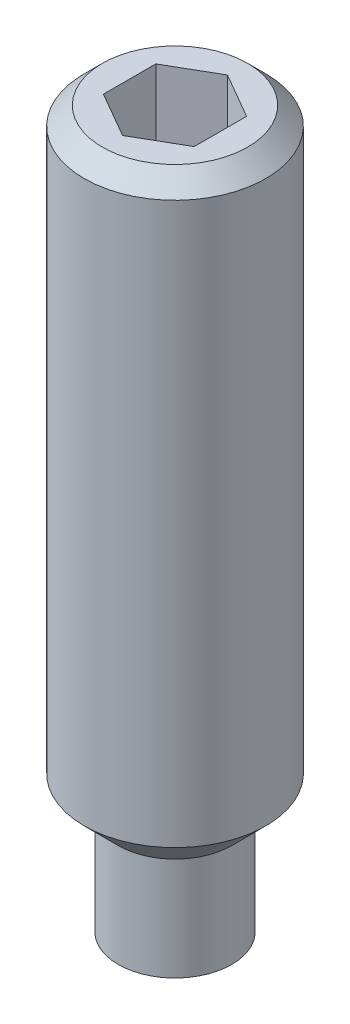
ISO-10303-21;
HEADER;
FILE_DESCRIPTION(('STEP AP214'),'2;1');
FILE_NAME('part.step','',(''),(''),'','','');
FILE_SCHEMA(('AUTOMOTIVE_DESIGN { 1 0 10303 214 1 1 1 1 }'));
ENDSEC;
DATA;
#1=APPLICATION_CONTEXT('core data for automotive mechanical design processes');
#2=APPLICATION_PROTOCOL_DEFINITION('international standard','automotive_design',2000,#1);
#3=PRODUCT_CONTEXT('',#1,'mechanical');
#4=PRODUCT('Part','Part','',(#3));
#5=PRODUCT_RELATED_PRODUCT_CATEGORY('part','',(#4));
#6=PRODUCT_DEFINITION_FORMATION('','',#4);
#7=PRODUCT_DEFINITION_CONTEXT('part definition',#1,'design');
#8=PRODUCT_DEFINITION('design','',#6,#7);
#9=PRODUCT_DEFINITION_SHAPE('','',#8);
#10=(LENGTH_UNIT() NAMED_UNIT(*) SI_UNIT(.MILLI.,.METRE.));
#11=(NAMED_UNIT(*) PLANE_ANGLE_UNIT() SI_UNIT($,.RADIAN.));
#12=(NAMED_UNIT(*) SI_UNIT($,.STERADIAN.) SOLID_ANGLE_UNIT());
#13=UNCERTAINTY_MEASURE_WITH_UNIT(LENGTH_MEASURE(1.E-05),#10,'distance_accuracy_value','');
#14=(GEOMETRIC_REPRESENTATION_CONTEXT(3) GLOBAL_UNCERTAINTY_ASSIGNED_CONTEXT((#13)) GLOBAL_UNIT_ASSIGNED_CONTEXT((#10,
#11,#12)) REPRESENTATION_CONTEXT('',''));
#15=CARTESIAN_POINT('',(0.,0.,0.));
#16=DIRECTION('',(0.,0.,1.));
#17=DIRECTION('',(1.,0.,0.));
#18=AXIS2_PLACEMENT_3D('',#15,#16,#17);
#19=CARTESIAN_POINT('',(0.,0.,0.));
#20=DIRECTION('',(0.,1.,0.));
#21=DIRECTION('',(0.,0.,1.));
#22=AXIS2_PLACEMENT_3D('',#19,#20,#21);
#23=CYLINDRICAL_SURFACE('',#22,2.);
#24=CARTESIAN_POINT('',(0.,-12.75,0.));
#25=DIRECTION('',(0.,1.,0.));
#26=DIRECTION('',(0.,0.,1.));
#27=AXIS2_PLACEMENT_3D('',#24,#25,#26);
#28=CIRCLE('',#27,2.);
#29=CARTESIAN_POINT('',(0.,-12.75,2.));
#30=VERTEX_POINT('',#29);
#31=EDGE_CURVE('E11',#30,#30,#28,.T.);
#32=ORIENTED_EDGE('',*,*,#31,.T.);
#33=EDGE_LOOP('',(#32));
#34=FACE_BOUND('',#33,.T.);
#35=CARTESIAN_POINT('',(0.,-0.400000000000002,0.));
#36=DIRECTION('',(0.,-1.,0.));
#37=DIRECTION('',(0.,0.,-1.));
#38=AXIS2_PLACEMENT_3D('',#35,#36,#37);
#39=CIRCLE('',#38,2.);
#40=CARTESIAN_POINT('',(0.,-0.400000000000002,-2.));
#41=VERTEX_POINT('',#40);
#42=EDGE_CURVE('E144',#41,#41,#39,.T.);
#43=ORIENTED_EDGE('',*,*,#42,.T.);
#44=EDGE_LOOP('',(#43));
#45=FACE_BOUND('',#44,.T.);
#46=ADVANCED_FACE('F29',(#34,#45),#23,.T.);
#47=CARTESIAN_POINT('',(0.,0.,0.));
#48=DIRECTION('',(0.,-1.,0.));
#49=DIRECTION('',(0.,0.,-1.));
#50=AXIS2_PLACEMENT_3D('',#47,#48,#49);
#51=PLANE('',#50);
#52=DIRECTION('',(0.866025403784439,0.,-0.5));
#53=VECTOR('',#52,1.);
#54=CARTESIAN_POINT('',(0.,0.,1.15470053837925));
#55=LINE('',#54,#53);
#56=CARTESIAN_POINT('',(0.,0.,1.15470053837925));
#57=VERTEX_POINT('',#56);
#58=CARTESIAN_POINT('',(0.999999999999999,0.,0.577350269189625));
#59=VERTEX_POINT('',#58);
#60=EDGE_CURVE('E98',#57,#59,#55,.T.);
#61=ORIENTED_EDGE('',*,*,#60,.F.);
#62=DIRECTION('',(0.866025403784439,0.,0.5));
#63=VECTOR('',#62,1.);
#64=CARTESIAN_POINT('',(-0.999999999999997,0.,0.577350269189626));
#65=LINE('',#64,#63);
#66=CARTESIAN_POINT('',(-0.999999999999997,0.,0.577350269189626));
#67=VERTEX_POINT('',#66);
#68=EDGE_CURVE('E44',#67,#57,#65,.T.);
#69=ORIENTED_EDGE('',*,*,#68,.F.);
#70=DIRECTION('',(0.,0.,1.));
#71=VECTOR('',#70,1.);
#72=CARTESIAN_POINT('',(-0.999999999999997,0.,-0.577350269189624));
#73=LINE('',#72,#71);
#74=CARTESIAN_POINT('',(-0.999999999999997,0.,-0.577350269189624));
#75=VERTEX_POINT('',#74);
#76=EDGE_CURVE('E114',#75,#67,#73,.T.);
#77=ORIENTED_EDGE('',*,*,#76,.F.);
#78=DIRECTION('',(-0.866025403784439,0.,0.5));
#79=VECTOR('',#78,1.);
#80=CARTESIAN_POINT('',(0.,0.,-1.15470053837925));
#81=LINE('',#80,#79);
#82=CARTESIAN_POINT('',(0.,0.,-1.15470053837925));
#83=VERTEX_POINT('',#82);
#84=EDGE_CURVE('E108',#83,#75,#81,.T.);
#85=ORIENTED_EDGE('',*,*,#84,.F.);
#86=DIRECTION('',(-0.866025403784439,0.,-0.5));
#87=VECTOR('',#86,1.);
#88=CARTESIAN_POINT('',(0.999999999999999,0.,-0.577350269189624));
#89=LINE('',#88,#87);
#90=CARTESIAN_POINT('',(0.999999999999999,0.,-0.577350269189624));
#91=VERTEX_POINT('',#90);
#92=EDGE_CURVE('E106',#91,#83,#89,.T.);
#93=ORIENTED_EDGE('',*,*,#92,.F.);
#94=DIRECTION('',(0.,0.,-1.));
#95=VECTOR('',#94,1.);
#96=CARTESIAN_POINT('',(0.999999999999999,0.,0.577350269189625));
#97=LINE('',#96,#95);
#98=EDGE_CURVE('E87',#59,#91,#97,.T.);
#99=ORIENTED_EDGE('',*,*,#98,.F.);
#100=EDGE_LOOP('',(#61,#69,#77,#85,#93,#99));
#101=FACE_BOUND('',#100,.T.);
#102=CARTESIAN_POINT('',(0.,0.,0.));
#103=DIRECTION('',(0.,-1.,0.));
#104=DIRECTION('',(0.,0.,-1.));
#105=AXIS2_PLACEMENT_3D('',#102,#103,#104);
#106=CIRCLE('',#105,1.6);
#107=CARTESIAN_POINT('',(0.,0.,-1.6));
#108=VERTEX_POINT('',#107);
#109=EDGE_CURVE('E141',#108,#108,#106,.F.);
#110=ORIENTED_EDGE('',*,*,#109,.T.);
#111=EDGE_LOOP('',(#110));
#112=FACE_BOUND('',#111,.T.);
#113=ADVANCED_FACE('F102',(#101,#112),#51,.F.);
#114=CARTESIAN_POINT('',(0.,0.,0.));
#115=DIRECTION('',(0.,-1.,0.));
#116=DIRECTION('',(0.,0.,-1.));
#117=AXIS2_PLACEMENT_3D('',#114,#115,#116);
#118=CONICAL_SURFACE('',#117,1.6,0.785398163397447);
#119=CARTESIAN_POINT('',(0.,-0.400000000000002,-2.));
#120=CARTESIAN_POINT('',(0.,-0.395833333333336,-1.99583333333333));
#121=CARTESIAN_POINT('',(0.,-0.391666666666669,-1.99166666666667));
#122=CARTESIAN_POINT('',(0.,-0.383333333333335,-1.98333333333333));
#123=CARTESIAN_POINT('',(0.,-0.379166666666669,-1.97916666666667));
#124=CARTESIAN_POINT('',(0.,-0.370833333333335,-1.97083333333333));
#125=CARTESIAN_POINT('',(0.,-0.366666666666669,-1.96666666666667));
#126=CARTESIAN_POINT('',(0.,-0.358333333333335,-1.95833333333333));
#127=CARTESIAN_POINT('',(0.,-0.354166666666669,-1.95416666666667));
#128=CARTESIAN_POINT('',(0.,-0.345833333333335,-1.94583333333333));
#129=CARTESIAN_POINT('',(0.,-0.341666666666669,-1.94166666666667));
#130=CARTESIAN_POINT('',(0.,-0.333333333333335,-1.93333333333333));
#131=CARTESIAN_POINT('',(0.,-0.329166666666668,-1.92916666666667));
#132=CARTESIAN_POINT('',(0.,-0.320833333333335,-1.92083333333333));
#133=CARTESIAN_POINT('',(0.,-0.316666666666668,-1.91666666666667));
#134=CARTESIAN_POINT('',(0.,-0.308333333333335,-1.90833333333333));
#135=CARTESIAN_POINT('',(0.,-0.304166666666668,-1.90416666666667));
#136=CARTESIAN_POINT('',(0.,-0.295833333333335,-1.89583333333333));
#137=CARTESIAN_POINT('',(0.,-0.291666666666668,-1.89166666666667));
#138=CARTESIAN_POINT('',(0.,-0.283333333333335,-1.88333333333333));
#139=CARTESIAN_POINT('',(0.,-0.279166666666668,-1.87916666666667));
#140=CARTESIAN_POINT('',(0.,-0.270833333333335,-1.87083333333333));
#141=CARTESIAN_POINT('',(0.,-0.266666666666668,-1.86666666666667));
#142=CARTESIAN_POINT('',(0.,-0.258333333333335,-1.85833333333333));
#143=CARTESIAN_POINT('',(0.,-0.254166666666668,-1.85416666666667));
#144=CARTESIAN_POINT('',(0.,-0.245833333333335,-1.84583333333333));
#145=CARTESIAN_POINT('',(0.,-0.241666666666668,-1.84166666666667));
#146=CARTESIAN_POINT('',(0.,-0.233333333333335,-1.83333333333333));
#147=CARTESIAN_POINT('',(0.,-0.229166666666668,-1.82916666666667));
#148=CARTESIAN_POINT('',(0.,-0.220833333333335,-1.82083333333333));
#149=CARTESIAN_POINT('',(0.,-0.216666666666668,-1.81666666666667));
#150=CARTESIAN_POINT('',(0.,-0.208333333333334,-1.80833333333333));
#151=CARTESIAN_POINT('',(0.,-0.204166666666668,-1.80416666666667));
#152=CARTESIAN_POINT('',(0.,-0.195833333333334,-1.79583333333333));
#153=CARTESIAN_POINT('',(0.,-0.191666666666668,-1.79166666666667));
#154=CARTESIAN_POINT('',(0.,-0.183333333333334,-1.78333333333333));
#155=CARTESIAN_POINT('',(0.,-0.179166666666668,-1.77916666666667));
#156=CARTESIAN_POINT('',(0.,-0.170833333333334,-1.77083333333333));
#157=CARTESIAN_POINT('',(0.,-0.166666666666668,-1.76666666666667));
#158=CARTESIAN_POINT('',(0.,-0.158333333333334,-1.75833333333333));
#159=CARTESIAN_POINT('',(0.,-0.154166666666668,-1.75416666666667));
#160=CARTESIAN_POINT('',(0.,-0.145833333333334,-1.74583333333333));
#161=CARTESIAN_POINT('',(0.,-0.141666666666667,-1.74166666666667));
#162=CARTESIAN_POINT('',(0.,-0.133333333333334,-1.73333333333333));
#163=CARTESIAN_POINT('',(0.,-0.129166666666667,-1.72916666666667));
#164=CARTESIAN_POINT('',(0.,-0.120833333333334,-1.72083333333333));
#165=CARTESIAN_POINT('',(0.,-0.116666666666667,-1.71666666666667));
#166=CARTESIAN_POINT('',(0.,-0.108333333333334,-1.70833333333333));
#167=CARTESIAN_POINT('',(0.,-0.104166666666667,-1.70416666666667));
#168=CARTESIAN_POINT('',(0.,-0.0958333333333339,-1.69583333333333));
#169=CARTESIAN_POINT('',(0.,-0.0916666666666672,-1.69166666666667));
#170=CARTESIAN_POINT('',(0.,-0.0833333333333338,-1.68333333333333));
#171=CARTESIAN_POINT('',(0.,-0.0791666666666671,-1.67916666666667));
#172=CARTESIAN_POINT('',(0.,-0.0708333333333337,-1.67083333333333));
#173=CARTESIAN_POINT('',(0.,-0.066666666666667,-1.66666666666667));
#174=CARTESIAN_POINT('',(0.,-0.0583333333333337,-1.65833333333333));
#175=CARTESIAN_POINT('',(0.,-0.054166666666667,-1.65416666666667));
#176=CARTESIAN_POINT('',(0.,-0.0458333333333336,-1.64583333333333));
#177=CARTESIAN_POINT('',(0.,-0.0416666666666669,-1.64166666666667));
#178=CARTESIAN_POINT('',(0.,-0.0333333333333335,-1.63333333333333));
#179=CARTESIAN_POINT('',(0.,-0.0291666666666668,-1.62916666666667));
#180=CARTESIAN_POINT('',(0.,-0.0208333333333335,-1.62083333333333));
#181=CARTESIAN_POINT('',(0.,-0.0166666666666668,-1.61666666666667));
#182=CARTESIAN_POINT('',(0.,-0.00833333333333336,-1.60833333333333));
#183=CARTESIAN_POINT('',(0.,-0.00416666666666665,-1.60416666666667));
#184=CARTESIAN_POINT('',(0.,0.,-1.6));
#185=B_SPLINE_CURVE_WITH_KNOTS('',3,(#119,#120,#121,#122,#123,#124,#125,#126,#127,#128,#129,
#130,#131,#132,#133,#134,#135,#136,#137,#138,#139,#140,#141,#142,#143,#144,#145,#146,#147,#148,
#149,#150,#151,#152,#153,#154,#155,#156,#157,#158,#159,#160,#161,#162,#163,#164,#165,#166,#167,
#168,#169,#170,#171,#172,#173,#174,#175,#176,#177,#178,#179,#180,#181,#182,#183,#184),
.UNSPECIFIED.,.F.,.F.,(4,2,2,2,2,2,2,2,2,2,2,2,2,2,2,2,2,2,2,2,2,2,2,2,2,2,2,2,2,2,2,2,4),(0.,
0.0176776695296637,0.0353553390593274,0.0530330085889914,0.0707106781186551,0.0883883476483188,
0.106066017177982,0.123743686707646,0.14142135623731,0.159099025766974,0.176776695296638,
0.194454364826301,0.212132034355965,0.229809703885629,0.247487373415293,0.265165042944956,
0.28284271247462,0.300520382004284,0.318198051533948,0.335875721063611,0.353553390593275,
0.371231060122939,0.388908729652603,0.406586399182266,0.42426406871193,0.441941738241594,
0.459619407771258,0.477297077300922,0.494974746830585,0.512652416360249,0.530330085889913,
0.548007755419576,0.56568542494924),.UNSPECIFIED.);
#186=EDGE_CURVE('BSEAM166',#41,#108,#185,.T.);
#187=ORIENTED_EDGE('',*,*,#42,.F.);
#188=ORIENTED_EDGE('',*,*,#109,.F.);
#189=ORIENTED_EDGE('',*,*,#186,.T.);
#190=ORIENTED_EDGE('',*,*,#186,.F.);
#191=EDGE_LOOP('',(#187,#189,#188,#190));
#192=FACE_BOUND('',#191,.T.);
#193=ADVANCED_FACE('F166',(#192),#118,.T.);
#194=CARTESIAN_POINT('',(0.,-20.7033639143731,0.));
#195=DIRECTION('',(0.,-1.,0.));
#196=DIRECTION('',(0.,0.,-1.));
#197=AXIS2_PLACEMENT_3D('',#194,#195,#196);
#198=CYLINDRICAL_SURFACE('',#197,1.25);
#199=CARTESIAN_POINT('',(0.,-15.7690598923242,0.));
#200=DIRECTION('',(0.,1.,0.));
#201=DIRECTION('',(0.,0.,1.));
#202=AXIS2_PLACEMENT_3D('',#199,#200,#201);
#203=CIRCLE('',#202,1.25);
#204=CARTESIAN_POINT('',(0.,-15.7690598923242,1.25));
#205=VERTEX_POINT('',#204);
#206=EDGE_CURVE('E37',#205,#205,#203,.T.);
#207=ORIENTED_EDGE('',*,*,#206,.T.);
#208=EDGE_LOOP('',(#207));
#209=FACE_BOUND('',#208,.T.);
#210=CARTESIAN_POINT('',(0.,-13.5,0.));
#211=DIRECTION('',(0.,-1.,0.));
#212=DIRECTION('',(0.,0.,-1.));
#213=AXIS2_PLACEMENT_3D('',#210,#211,#212);
#214=CIRCLE('',#213,1.25);
#215=CARTESIAN_POINT('',(0.,-13.5,-1.25));
#216=VERTEX_POINT('',#215);
#217=EDGE_CURVE('E132',#216,#216,#214,.T.);
#218=ORIENTED_EDGE('',*,*,#217,.T.);
#219=EDGE_LOOP('',(#218));
#220=FACE_BOUND('',#219,.T.);
#221=ADVANCED_FACE('F152',(#209,#220),#198,.T.);
#222=CARTESIAN_POINT('',(0.,-16.,0.));
#223=DIRECTION('',(0.,1.,0.));
#224=DIRECTION('',(0.,0.,1.));
#225=AXIS2_PLACEMENT_3D('',#222,#223,#224);
#226=PLANE('',#225);
#227=CARTESIAN_POINT('',(0.,-16.,0.));
#228=DIRECTION('',(0.,1.,0.));
#229=DIRECTION('',(0.,0.,1.));
#230=AXIS2_PLACEMENT_3D('',#227,#228,#229);
#231=CIRCLE('',#230,0.850000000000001);
#232=CARTESIAN_POINT('',(0.,-16.,0.849999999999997));
#233=VERTEX_POINT('',#232);
#234=EDGE_CURVE('E147',#233,#233,#231,.F.);
#235=ORIENTED_EDGE('',*,*,#234,.T.);
#236=EDGE_LOOP('',(#235));
#237=FACE_BOUND('',#236,.T.);
#238=ADVANCED_FACE('F31',(#237),#226,.F.);
#239=CARTESIAN_POINT('',(0.,-16.,0.));
#240=DIRECTION('',(0.,1.,0.));
#241=DIRECTION('',(0.,0.,1.));
#242=AXIS2_PLACEMENT_3D('',#239,#240,#241);
#243=CONICAL_SURFACE('',#242,0.850000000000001,1.0471975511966);
#244=CARTESIAN_POINT('',(0.,-15.7690598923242,1.25));
#245=CARTESIAN_POINT('',(0.,-15.7714655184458,1.24583333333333));
#246=CARTESIAN_POINT('',(0.,-15.7738711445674,1.24166666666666));
#247=CARTESIAN_POINT('',(0.,-15.7786823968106,1.23333333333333));
#248=CARTESIAN_POINT('',(0.,-15.7810880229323,1.22916666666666));
#249=CARTESIAN_POINT('',(0.,-15.7858992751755,1.22083333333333));
#250=CARTESIAN_POINT('',(0.,-15.7883049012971,1.21666666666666));
#251=CARTESIAN_POINT('',(0.,-15.7931161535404,1.20833333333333));
#252=CARTESIAN_POINT('',(0.,-15.795521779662,1.20416666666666));
#253=CARTESIAN_POINT('',(0.,-15.8003330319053,1.19583333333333));
#254=CARTESIAN_POINT('',(0.,-15.8027386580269,1.19166666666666));
#255=CARTESIAN_POINT('',(0.,-15.8075499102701,1.18333333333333));
#256=CARTESIAN_POINT('',(0.,-15.8099555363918,1.17916666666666));
#257=CARTESIAN_POINT('',(0.,-15.814766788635,1.17083333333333));
#258=CARTESIAN_POINT('',(0.,-15.8171724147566,1.16666666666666));
#259=CARTESIAN_POINT('',(0.,-15.8219836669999,1.15833333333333));
#260=CARTESIAN_POINT('',(0.,-15.8243892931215,1.15416666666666));
#261=CARTESIAN_POINT('',(0.,-15.8292005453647,1.14583333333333));
#262=CARTESIAN_POINT('',(0.,-15.8316061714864,1.14166666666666));
#263=CARTESIAN_POINT('',(0.,-15.8364174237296,1.13333333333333));
#264=CARTESIAN_POINT('',(0.,-15.8388230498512,1.12916666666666));
#265=CARTESIAN_POINT('',(0.,-15.8436343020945,1.12083333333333));
#266=CARTESIAN_POINT('',(0.,-15.8460399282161,1.11666666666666));
#267=CARTESIAN_POINT('',(0.,-15.8508511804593,1.10833333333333));
#268=CARTESIAN_POINT('',(0.,-15.853256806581,1.10416666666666));
#269=CARTESIAN_POINT('',(0.,-15.8580680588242,1.09583333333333));
#270=CARTESIAN_POINT('',(0.,-15.8604736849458,1.09166666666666));
#271=CARTESIAN_POINT('',(0.,-15.8652849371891,1.08333333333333));
#272=CARTESIAN_POINT('',(0.,-15.8676905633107,1.07916666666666));
#273=CARTESIAN_POINT('',(0.,-15.872501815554,1.07083333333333));
#274=CARTESIAN_POINT('',(0.,-15.8749074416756,1.06666666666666));
#275=CARTESIAN_POINT('',(0.,-15.8797186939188,1.05833333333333));
#276=CARTESIAN_POINT('',(0.,-15.8821243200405,1.05416666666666));
#277=CARTESIAN_POINT('',(0.,-15.8869355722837,1.04583333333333));
#278=CARTESIAN_POINT('',(0.,-15.8893411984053,1.04166666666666));
#279=CARTESIAN_POINT('',(0.,-15.8941524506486,1.03333333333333));
#280=CARTESIAN_POINT('',(0.,-15.8965580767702,1.02916666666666));
#281=CARTESIAN_POINT('',(0.,-15.9013693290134,1.02083333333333));
#282=CARTESIAN_POINT('',(0.,-15.9037749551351,1.01666666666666));
#283=CARTESIAN_POINT('',(0.,-15.9085862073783,1.00833333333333));
#284=CARTESIAN_POINT('',(0.,-15.9109918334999,1.00416666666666));
#285=CARTESIAN_POINT('',(0.,-15.9158030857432,0.995833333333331));
#286=CARTESIAN_POINT('',(0.,-15.9182087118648,0.991666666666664));
#287=CARTESIAN_POINT('',(0.,-15.9230199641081,0.983333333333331));
#288=CARTESIAN_POINT('',(0.,-15.9254255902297,0.979166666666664));
#289=CARTESIAN_POINT('',(0.,-15.9302368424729,0.97083333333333));
#290=CARTESIAN_POINT('',(0.,-15.9326424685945,0.966666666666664));
#291=CARTESIAN_POINT('',(0.,-15.9374537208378,0.958333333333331));
#292=CARTESIAN_POINT('',(0.,-15.9398593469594,0.954166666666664));
#293=CARTESIAN_POINT('',(0.,-15.9446705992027,0.945833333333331));
#294=CARTESIAN_POINT('',(0.,-15.9470762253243,0.941666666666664));
#295=CARTESIAN_POINT('',(0.,-15.9518874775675,0.93333333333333));
#296=CARTESIAN_POINT('',(0.,-15.9542931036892,0.929166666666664));
#297=CARTESIAN_POINT('',(0.,-15.9591043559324,0.920833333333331));
#298=CARTESIAN_POINT('',(0.,-15.961509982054,0.916666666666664));
#299=CARTESIAN_POINT('',(0.,-15.9663212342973,0.908333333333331));
#300=CARTESIAN_POINT('',(0.,-15.9687268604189,0.904166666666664));
#301=CARTESIAN_POINT('',(0.,-15.9735381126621,0.895833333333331));
#302=CARTESIAN_POINT('',(0.,-15.9759437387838,0.891666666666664));
#303=CARTESIAN_POINT('',(0.,-15.980754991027,0.883333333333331));
#304=CARTESIAN_POINT('',(0.,-15.9831606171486,0.879166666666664));
#305=CARTESIAN_POINT('',(0.,-15.9879718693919,0.870833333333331));
#306=CARTESIAN_POINT('',(0.,-15.9903774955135,0.866666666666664));
#307=CARTESIAN_POINT('',(0.,-15.9951887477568,0.858333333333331));
#308=CARTESIAN_POINT('',(0.,-15.9975943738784,0.854166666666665));
#309=CARTESIAN_POINT('',(0.,-16.,0.849999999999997));
#310=B_SPLINE_CURVE_WITH_KNOTS('',3,(#244,#245,#246,#247,#248,#249,#250,#251,#252,#253,#254,
#255,#256,#257,#258,#259,#260,#261,#262,#263,#264,#265,#266,#267,#268,#269,#270,#271,#272,#273,
#274,#275,#276,#277,#278,#279,#280,#281,#282,#283,#284,#285,#286,#287,#288,#289,#290,#291,#292,
#293,#294,#295,#296,#297,#298,#299,#300,#301,#302,#303,#304,#305,#306,#307,#308,#309),
.UNSPECIFIED.,.F.,.F.,(4,2,2,2,2,2,2,2,2,2,2,2,2,2,2,2,2,2,2,2,2,2,2,2,2,2,2,2,2,2,2,2,4),(0.,
0.0144337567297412,0.0288675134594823,0.0433012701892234,0.0577350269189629,0.0721687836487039,
0.086602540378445,0.101036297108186,0.115470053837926,0.129903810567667,0.144337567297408,
0.158771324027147,0.173205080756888,0.187638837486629,0.202072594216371,0.21650635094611,
0.230940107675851,0.245373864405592,0.259807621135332,0.274241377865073,0.288675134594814,
0.303108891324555,0.317542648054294,0.331976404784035,0.346410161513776,0.360843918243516,
0.375277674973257,0.389711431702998,0.404145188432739,0.418578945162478,0.43301270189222,
0.447446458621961,0.4618802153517),.UNSPECIFIED.);
#311=EDGE_CURVE('BSEAM155',#205,#233,#310,.T.);
#312=ORIENTED_EDGE('',*,*,#206,.F.);
#313=ORIENTED_EDGE('',*,*,#234,.F.);
#314=ORIENTED_EDGE('',*,*,#311,.T.);
#315=ORIENTED_EDGE('',*,*,#311,.F.);
#316=EDGE_LOOP('',(#312,#314,#313,#315));
#317=FACE_BOUND('',#316,.T.);
#318=ADVANCED_FACE('F155',(#317),#243,.T.);
#319=CARTESIAN_POINT('',(-0.999999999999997,-2.,0.577350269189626));
#320=DIRECTION('',(-0.499999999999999,0.,0.866025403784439));
#321=DIRECTION('',(0.866025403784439,0.,0.499999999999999));
#322=AXIS2_PLACEMENT_3D('',#319,#320,#321);
#323=PLANE('',#322);
#324=ORIENTED_EDGE('',*,*,#68,.T.);
#325=DIRECTION('',(0.,1.,0.));
#326=VECTOR('',#325,1.);
#327=CARTESIAN_POINT('',(0.,-2.,1.15470053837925));
#328=LINE('',#327,#326);
#329=CARTESIAN_POINT('',(0.,-2.,1.15470053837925));
#330=VERTEX_POINT('',#329);
#331=EDGE_CURVE('E95',#330,#57,#328,.T.);
#332=ORIENTED_EDGE('',*,*,#331,.F.);
#333=DIRECTION('',(0.866025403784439,0.,0.5));
#334=VECTOR('',#333,1.);
#335=CARTESIAN_POINT('',(-0.999999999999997,-2.,0.577350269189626));
#336=LINE('',#335,#334);
#337=CARTESIAN_POINT('',(-0.999999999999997,-2.,0.577350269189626));
#338=VERTEX_POINT('',#337);
#339=EDGE_CURVE('E116',#338,#330,#336,.T.);
#340=ORIENTED_EDGE('',*,*,#339,.F.);
#341=DIRECTION('',(0.,1.,0.));
#342=VECTOR('',#341,1.);
#343=CARTESIAN_POINT('',(-0.999999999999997,-2.,0.577350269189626));
#344=LINE('',#343,#342);
#345=EDGE_CURVE('E51',#338,#67,#344,.T.);
#346=ORIENTED_EDGE('',*,*,#345,.T.);
#347=EDGE_LOOP('',(#324,#332,#340,#346));
#348=FACE_BOUND('',#347,.T.);
#349=ADVANCED_FACE('F158',(#348),#323,.F.);
#350=CARTESIAN_POINT('',(-0.999999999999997,-2.,-0.577350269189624));
#351=DIRECTION('',(-1.,0.,0.));
#352=DIRECTION('',(0.,0.,1.));
#353=AXIS2_PLACEMENT_3D('',#350,#351,#352);
#354=PLANE('',#353);
#355=ORIENTED_EDGE('',*,*,#76,.T.);
#356=ORIENTED_EDGE('',*,*,#345,.F.);
#357=DIRECTION('',(0.,0.,1.));
#358=VECTOR('',#357,1.);
#359=CARTESIAN_POINT('',(-0.999999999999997,-2.,-0.577350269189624));
#360=LINE('',#359,#358);
#361=CARTESIAN_POINT('',(-0.999999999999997,-2.,-0.577350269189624));
#362=VERTEX_POINT('',#361);
#363=EDGE_CURVE('E128',#362,#338,#360,.T.);
#364=ORIENTED_EDGE('',*,*,#363,.F.);
#365=DIRECTION('',(0.,1.,0.));
#366=VECTOR('',#365,1.);
#367=CARTESIAN_POINT('',(-0.999999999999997,-2.,-0.577350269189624));
#368=LINE('',#367,#366);
#369=EDGE_CURVE('E133',#362,#75,#368,.T.);
#370=ORIENTED_EDGE('',*,*,#369,.T.);
#371=EDGE_LOOP('',(#355,#356,#364,#370));
#372=FACE_BOUND('',#371,.T.);
#373=ADVANCED_FACE('F181',(#372),#354,.F.);
#374=CARTESIAN_POINT('',(0.,-2.,-1.15470053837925));
#375=DIRECTION('',(-0.5,0.,-0.866025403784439));
#376=DIRECTION('',(-0.866025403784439,0.,0.5));
#377=AXIS2_PLACEMENT_3D('',#374,#375,#376);
#378=PLANE('',#377);
#379=ORIENTED_EDGE('',*,*,#84,.T.);
#380=ORIENTED_EDGE('',*,*,#369,.F.);
#381=DIRECTION('',(-0.866025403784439,0.,0.5));
#382=VECTOR('',#381,1.);
#383=CARTESIAN_POINT('',(0.,-2.,-1.15470053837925));
#384=LINE('',#383,#382);
#385=CARTESIAN_POINT('',(0.,-2.,-1.15470053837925));
#386=VERTEX_POINT('',#385);
#387=EDGE_CURVE('E125',#386,#362,#384,.T.);
#388=ORIENTED_EDGE('',*,*,#387,.F.);
#389=DIRECTION('',(0.,1.,0.));
#390=VECTOR('',#389,1.);
#391=CARTESIAN_POINT('',(0.,-2.,-1.15470053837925));
#392=LINE('',#391,#390);
#393=EDGE_CURVE('E135',#386,#83,#392,.T.);
#394=ORIENTED_EDGE('',*,*,#393,.T.);
#395=EDGE_LOOP('',(#379,#380,#388,#394));
#396=FACE_BOUND('',#395,.T.);
#397=ADVANCED_FACE('F190',(#396),#378,.F.);
#398=CARTESIAN_POINT('',(0.999999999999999,-2.,-0.577350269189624));
#399=DIRECTION('',(0.5,0.,-0.866025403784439));
#400=DIRECTION('',(-0.866025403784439,0.,-0.5));
#401=AXIS2_PLACEMENT_3D('',#398,#399,#400);
#402=PLANE('',#401);
#403=ORIENTED_EDGE('',*,*,#92,.T.);
#404=ORIENTED_EDGE('',*,*,#393,.F.);
#405=DIRECTION('',(-0.866025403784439,0.,-0.5));
#406=VECTOR('',#405,1.);
#407=CARTESIAN_POINT('',(0.999999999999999,-2.,-0.577350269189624));
#408=LINE('',#407,#406);
#409=CARTESIAN_POINT('',(0.999999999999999,-2.,-0.577350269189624));
#410=VERTEX_POINT('',#409);
#411=EDGE_CURVE('E122',#410,#386,#408,.T.);
#412=ORIENTED_EDGE('',*,*,#411,.F.);
#413=DIRECTION('',(0.,1.,0.));
#414=VECTOR('',#413,1.);
#415=CARTESIAN_POINT('',(0.999999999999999,-2.,-0.577350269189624));
#416=LINE('',#415,#414);
#417=EDGE_CURVE('E94',#410,#91,#416,.T.);
#418=ORIENTED_EDGE('',*,*,#417,.T.);
#419=EDGE_LOOP('',(#403,#404,#412,#418));
#420=FACE_BOUND('',#419,.T.);
#421=ADVANCED_FACE('F187',(#420),#402,.F.);
#422=CARTESIAN_POINT('',(0.999999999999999,-2.,0.577350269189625));
#423=DIRECTION('',(1.,0.,0.));
#424=DIRECTION('',(0.,0.,-1.));
#425=AXIS2_PLACEMENT_3D('',#422,#423,#424);
#426=PLANE('',#425);
#427=ORIENTED_EDGE('',*,*,#98,.T.);
#428=ORIENTED_EDGE('',*,*,#417,.F.);
#429=DIRECTION('',(0.,0.,-1.));
#430=VECTOR('',#429,1.);
#431=CARTESIAN_POINT('',(0.999999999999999,-2.,0.577350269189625));
#432=LINE('',#431,#430);
#433=CARTESIAN_POINT('',(0.999999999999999,-2.,0.577350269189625));
#434=VERTEX_POINT('',#433);
#435=EDGE_CURVE('E90',#434,#410,#432,.T.);
#436=ORIENTED_EDGE('',*,*,#435,.F.);
#437=DIRECTION('',(0.,1.,0.));
#438=VECTOR('',#437,1.);
#439=CARTESIAN_POINT('',(0.999999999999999,-2.,0.577350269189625));
#440=LINE('',#439,#438);
#441=EDGE_CURVE('E83',#434,#59,#440,.T.);
#442=ORIENTED_EDGE('',*,*,#441,.T.);
#443=EDGE_LOOP('',(#427,#428,#436,#442));
#444=FACE_BOUND('',#443,.T.);
#445=ADVANCED_FACE('F85',(#444),#426,.F.);
#446=CARTESIAN_POINT('',(0.,-2.,1.15470053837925));
#447=DIRECTION('',(0.5,0.,0.866025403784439));
#448=DIRECTION('',(0.866025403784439,0.,-0.5));
#449=AXIS2_PLACEMENT_3D('',#446,#447,#448);
#450=PLANE('',#449);
#451=ORIENTED_EDGE('',*,*,#60,.T.);
#452=ORIENTED_EDGE('',*,*,#441,.F.);
#453=DIRECTION('',(0.866025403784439,0.,-0.5));
#454=VECTOR('',#453,1.);
#455=CARTESIAN_POINT('',(0.,-2.,1.15470053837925));
#456=LINE('',#455,#454);
#457=EDGE_CURVE('E119',#330,#434,#456,.T.);
#458=ORIENTED_EDGE('',*,*,#457,.F.);
#459=ORIENTED_EDGE('',*,*,#331,.T.);
#460=EDGE_LOOP('',(#451,#452,#458,#459));
#461=FACE_BOUND('',#460,.T.);
#462=ADVANCED_FACE('F99',(#461),#450,.F.);
#463=CARTESIAN_POINT('',(-0.999999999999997,-2.,0.577350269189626));
#464=DIRECTION('',(0.,-1.,0.));
#465=DIRECTION('',(0.,0.,-1.));
#466=AXIS2_PLACEMENT_3D('',#463,#464,#465);
#467=PLANE('',#466);
#468=ORIENTED_EDGE('',*,*,#339,.T.);
#469=ORIENTED_EDGE('',*,*,#457,.T.);
#470=ORIENTED_EDGE('',*,*,#435,.T.);
#471=ORIENTED_EDGE('',*,*,#411,.T.);
#472=ORIENTED_EDGE('',*,*,#387,.T.);
#473=ORIENTED_EDGE('',*,*,#363,.T.);
#474=EDGE_LOOP('',(#468,#469,#470,#471,#472,#473));
#475=FACE_BOUND('',#474,.T.);
#476=ADVANCED_FACE('F184',(#475),#467,.F.);
#477=CARTESIAN_POINT('',(0.,-13.5,0.));
#478=DIRECTION('',(0.,1.,0.));
#479=DIRECTION('',(0.,0.,1.));
#480=AXIS2_PLACEMENT_3D('',#477,#478,#479);
#481=CONICAL_SURFACE('',#480,1.25,0.785398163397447);
#482=ORIENTED_EDGE('',*,*,#31,.F.);
#483=EDGE_LOOP('',(#482));
#484=FACE_BOUND('',#483,.T.);
#485=ORIENTED_EDGE('',*,*,#217,.F.);
#486=EDGE_LOOP('',(#485));
#487=FACE_BOUND('',#486,.T.);
#488=ADVANCED_FACE('F199',(#484,#487),#481,.T.);
#489=CLOSED_SHELL('',(#46,#113,#193,#221,#238,#318,#349,#373,#397,#421,#445,#462,#476,#488));
#490=MANIFOLD_SOLID_BREP('B2',#489);
#491=ADVANCED_BREP_SHAPE_REPRESENTATION('',(#18,#490),#14);
#492=SHAPE_DEFINITION_REPRESENTATION(#9,#491);
ENDSEC;
END-ISO-10303-21;
